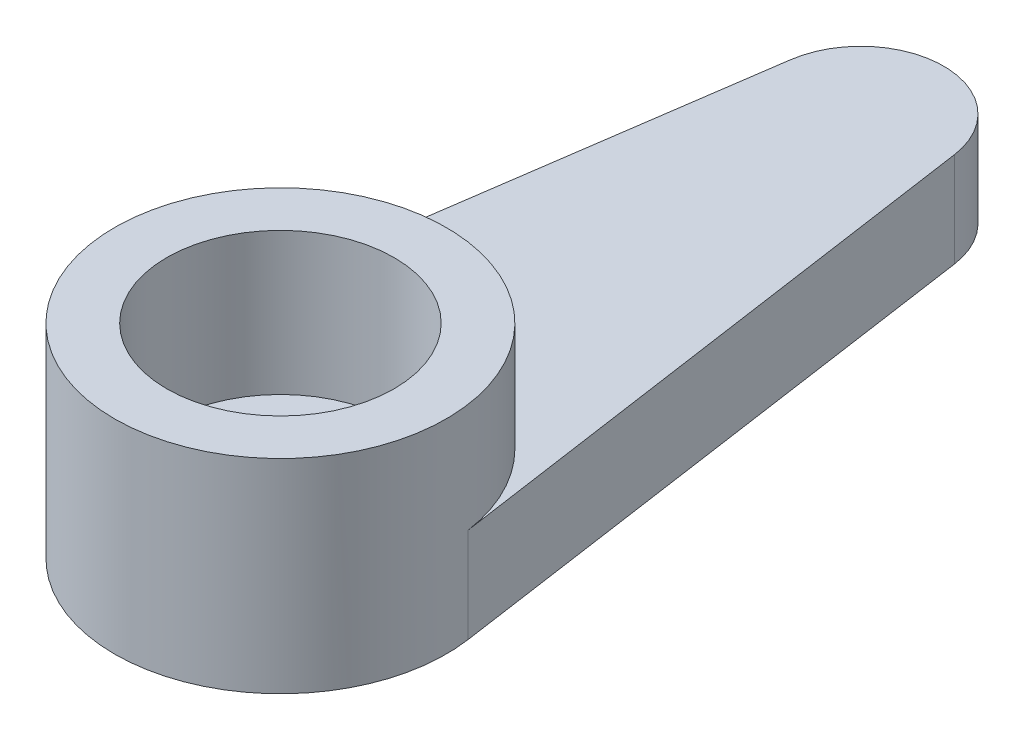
ISO-10303-21;
HEADER;
FILE_DESCRIPTION(('STEP AP214'),'2;1');
FILE_NAME('part.step','',(''),(''),'','','');
FILE_SCHEMA(('AUTOMOTIVE_DESIGN { 1 0 10303 214 1 1 1 1 }'));
ENDSEC;
DATA;
#1=APPLICATION_CONTEXT('core data for automotive mechanical design processes');
#2=APPLICATION_PROTOCOL_DEFINITION('international standard','automotive_design',2000,#1);
#3=PRODUCT_CONTEXT('',#1,'mechanical');
#4=PRODUCT('Part','Part','',(#3));
#5=PRODUCT_RELATED_PRODUCT_CATEGORY('part','',(#4));
#6=PRODUCT_DEFINITION_FORMATION('','',#4);
#7=PRODUCT_DEFINITION_CONTEXT('part definition',#1,'design');
#8=PRODUCT_DEFINITION('design','',#6,#7);
#9=PRODUCT_DEFINITION_SHAPE('','',#8);
#10=(LENGTH_UNIT() NAMED_UNIT(*) SI_UNIT(.MILLI.,.METRE.));
#11=(NAMED_UNIT(*) PLANE_ANGLE_UNIT() SI_UNIT($,.RADIAN.));
#12=(NAMED_UNIT(*) SI_UNIT($,.STERADIAN.) SOLID_ANGLE_UNIT());
#13=UNCERTAINTY_MEASURE_WITH_UNIT(LENGTH_MEASURE(1.E-05),#10,'distance_accuracy_value','');
#14=(GEOMETRIC_REPRESENTATION_CONTEXT(3) GLOBAL_UNCERTAINTY_ASSIGNED_CONTEXT((#13)) GLOBAL_UNIT_ASSIGNED_CONTEXT((#10,
#11,#12)) REPRESENTATION_CONTEXT('',''));
#15=CARTESIAN_POINT('',(0.,0.,0.));
#16=DIRECTION('',(0.,0.,1.));
#17=DIRECTION('',(1.,0.,0.));
#18=AXIS2_PLACEMENT_3D('',#15,#16,#17);
#19=CARTESIAN_POINT('',(0.,1.3,0.));
#20=DIRECTION('',(0.,1.,0.));
#21=DIRECTION('',(0.,0.,1.));
#22=AXIS2_PLACEMENT_3D('',#19,#20,#21);
#23=PLANE('',#22);
#24=CARTESIAN_POINT('',(0.,1.3,0.));
#25=DIRECTION('',(0.,-1.,0.));
#26=DIRECTION('',(0.,0.,-1.));
#27=AXIS2_PLACEMENT_3D('',#24,#25,#26);
#28=CIRCLE('',#27,1.);
#29=CARTESIAN_POINT('',(0.,1.3,-1.));
#30=VERTEX_POINT('',#29);
#31=EDGE_CURVE('E102',#30,#30,#28,.T.);
#32=ORIENTED_EDGE('',*,*,#31,.T.);
#33=EDGE_LOOP('',(#32));
#34=FACE_BOUND('',#33,.T.);
#35=CARTESIAN_POINT('',(0.,1.3,0.));
#36=DIRECTION('',(0.,1.,0.));
#37=DIRECTION('',(0.,0.,1.));
#38=AXIS2_PLACEMENT_3D('',#35,#36,#37);
#39=CIRCLE('',#38,2.4);
#40=CARTESIAN_POINT('',(0.,1.3,2.4));
#41=VERTEX_POINT('',#40);
#42=EDGE_CURVE('E19',#41,#41,#39,.T.);
#43=ORIENTED_EDGE('',*,*,#42,.T.);
#44=EDGE_LOOP('',(#43));
#45=FACE_BOUND('',#44,.T.);
#46=ADVANCED_FACE('F16',(#34,#45),#23,.T.);
#47=CARTESIAN_POINT('',(0.,4.3,0.));
#48=DIRECTION('',(0.,1.,0.));
#49=DIRECTION('',(0.,0.,1.));
#50=AXIS2_PLACEMENT_3D('',#47,#48,#49);
#51=CYLINDRICAL_SURFACE('',#50,2.4);
#52=CARTESIAN_POINT('',(0.,4.3,0.));
#53=DIRECTION('',(0.,1.,0.));
#54=DIRECTION('',(0.,0.,1.));
#55=AXIS2_PLACEMENT_3D('',#52,#53,#54);
#56=CIRCLE('',#55,2.4);
#57=CARTESIAN_POINT('',(0.,4.3,2.4));
#58=VERTEX_POINT('',#57);
#59=EDGE_CURVE('E100',#58,#58,#56,.F.);
#60=ORIENTED_EDGE('',*,*,#59,.F.);
#61=EDGE_LOOP('',(#60));
#62=FACE_BOUND('',#61,.T.);
#63=ORIENTED_EDGE('',*,*,#42,.F.);
#64=EDGE_LOOP('',(#63));
#65=FACE_BOUND('',#64,.T.);
#66=ADVANCED_FACE('F110',(#62,#65),#51,.F.);
#67=CARTESIAN_POINT('',(0.,0.,0.));
#68=DIRECTION('',(0.,-1.,0.));
#69=DIRECTION('',(0.,0.,-1.));
#70=AXIS2_PLACEMENT_3D('',#67,#68,#69);
#71=CYLINDRICAL_SURFACE('',#70,1.);
#72=CARTESIAN_POINT('',(0.,0.5,0.));
#73=DIRECTION('',(0.,-1.,0.));
#74=DIRECTION('',(0.,0.,-1.));
#75=AXIS2_PLACEMENT_3D('',#72,#73,#74);
#76=CIRCLE('',#75,1.);
#77=CARTESIAN_POINT('',(0.,0.5,-1.));
#78=VERTEX_POINT('',#77);
#79=EDGE_CURVE('E97',#78,#78,#76,.F.);
#80=ORIENTED_EDGE('',*,*,#79,.F.);
#81=EDGE_LOOP('',(#80));
#82=FACE_BOUND('',#81,.T.);
#83=ORIENTED_EDGE('',*,*,#31,.F.);
#84=EDGE_LOOP('',(#83));
#85=FACE_BOUND('',#84,.T.);
#86=ADVANCED_FACE('F112',(#82,#85),#71,.F.);
#87=CARTESIAN_POINT('',(0.,4.3,0.));
#88=DIRECTION('',(0.,1.,0.));
#89=DIRECTION('',(0.,0.,1.));
#90=AXIS2_PLACEMENT_3D('',#87,#88,#89);
#91=PLANE('',#90);
#92=ORIENTED_EDGE('',*,*,#59,.T.);
#93=EDGE_LOOP('',(#92));
#94=FACE_BOUND('',#93,.T.);
#95=CARTESIAN_POINT('',(0.,4.3,0.));
#96=DIRECTION('',(0.,1.,0.));
#97=DIRECTION('',(0.,0.,1.));
#98=AXIS2_PLACEMENT_3D('',#95,#96,#97);
#99=CIRCLE('',#98,3.5);
#100=CARTESIAN_POINT('',(0.,4.3,3.5));
#101=VERTEX_POINT('',#100);
#102=EDGE_CURVE('E74',#101,#101,#99,.F.);
#103=ORIENTED_EDGE('',*,*,#102,.F.);
#104=EDGE_LOOP('',(#103));
#105=FACE_BOUND('',#104,.T.);
#106=ADVANCED_FACE('F119',(#94,#105),#91,.T.);
#107=CARTESIAN_POINT('',(0.,2.,0.));
#108=DIRECTION('',(0.,1.,0.));
#109=DIRECTION('',(0.,0.,1.));
#110=AXIS2_PLACEMENT_3D('',#107,#108,#109);
#111=PLANE('',#110);
#112=DIRECTION('',(-0.142857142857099,0.,-0.989743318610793));
#113=VECTOR('',#112,1.);
#114=CARTESIAN_POINT('',(3.464101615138,2.,-0.5));
#115=LINE('',#114,#113);
#116=CARTESIAN_POINT('',(1.73205080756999,2.,-12.499999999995));
#117=VERTEX_POINT('',#116);
#118=CARTESIAN_POINT('',(3.46410161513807,2.,-0.499999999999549));
#119=VERTEX_POINT('',#118);
#120=EDGE_CURVE('E55',#117,#119,#115,.F.);
#121=ORIENTED_EDGE('',*,*,#120,.F.);
#122=CARTESIAN_POINT('',(0.,2.,-12.25));
#123=DIRECTION('',(0.,1.,0.));
#124=DIRECTION('',(0.,0.,1.));
#125=AXIS2_PLACEMENT_3D('',#122,#123,#124);
#126=CIRCLE('',#125,1.75);
#127=CARTESIAN_POINT('',(-1.732050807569,2.,-12.5));
#128=VERTEX_POINT('',#127);
#129=EDGE_CURVE('E79',#128,#117,#126,.F.);
#130=ORIENTED_EDGE('',*,*,#129,.F.);
#131=DIRECTION('',(-0.142857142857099,0.,0.989743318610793));
#132=VECTOR('',#131,1.);
#133=CARTESIAN_POINT('',(-1.732050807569,2.,-12.5));
#134=LINE('',#133,#132);
#135=CARTESIAN_POINT('',(-3.46410161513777,2.,-0.499999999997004));
#136=VERTEX_POINT('',#135);
#137=EDGE_CURVE('E70',#136,#128,#134,.F.);
#138=ORIENTED_EDGE('',*,*,#137,.F.);
#139=CARTESIAN_POINT('',(0.,2.,0.));
#140=DIRECTION('',(0.,1.,0.));
#141=DIRECTION('',(0.,0.,1.));
#142=AXIS2_PLACEMENT_3D('',#139,#140,#141);
#143=CIRCLE('',#142,3.5);
#144=EDGE_CURVE('E65',#119,#136,#143,.T.);
#145=ORIENTED_EDGE('',*,*,#144,.F.);
#146=EDGE_LOOP('',(#121,#130,#138,#145));
#147=FACE_BOUND('',#146,.T.);
#148=ADVANCED_FACE('F69',(#147),#111,.T.);
#149=CARTESIAN_POINT('',(0.,0.5,0.));
#150=DIRECTION('',(0.,-1.,0.));
#151=DIRECTION('',(0.,0.,-1.));
#152=AXIS2_PLACEMENT_3D('',#149,#150,#151);
#153=PLANE('',#152);
#154=ORIENTED_EDGE('',*,*,#79,.T.);
#155=EDGE_LOOP('',(#154));
#156=FACE_BOUND('',#155,.T.);
#157=CARTESIAN_POINT('',(0.,0.5,0.));
#158=DIRECTION('',(0.,-1.,0.));
#159=DIRECTION('',(0.,0.,-1.));
#160=AXIS2_PLACEMENT_3D('',#157,#158,#159);
#161=CIRCLE('',#160,1.65);
#162=CARTESIAN_POINT('',(0.,0.5,-1.65));
#163=VERTEX_POINT('',#162);
#164=EDGE_CURVE('E91',#163,#163,#161,.T.);
#165=ORIENTED_EDGE('',*,*,#164,.T.);
#166=EDGE_LOOP('',(#165));
#167=FACE_BOUND('',#166,.T.);
#168=ADVANCED_FACE('F147',(#156,#167),#153,.T.);
#169=CARTESIAN_POINT('',(0.,0.,0.));
#170=DIRECTION('',(0.,1.,0.));
#171=DIRECTION('',(0.,0.,1.));
#172=AXIS2_PLACEMENT_3D('',#169,#170,#171);
#173=CYLINDRICAL_SURFACE('',#172,3.5);
#174=CARTESIAN_POINT('',(0.,0.,0.));
#175=DIRECTION('',(0.,1.,0.));
#176=DIRECTION('',(0.,0.,1.));
#177=AXIS2_PLACEMENT_3D('',#174,#175,#176);
#178=CIRCLE('',#177,3.5);
#179=CARTESIAN_POINT('',(-3.46410161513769,0.,-0.499999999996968));
#180=VERTEX_POINT('',#179);
#181=CARTESIAN_POINT('',(3.46410161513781,0.,-0.499999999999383));
#182=VERTEX_POINT('',#181);
#183=EDGE_CURVE('E78',#180,#182,#178,.T.);
#184=ORIENTED_EDGE('',*,*,#183,.T.);
#185=DIRECTION('',(0.,1.,0.));
#186=VECTOR('',#185,1.);
#187=CARTESIAN_POINT('',(3.46410161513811,0.,-0.499999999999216));
#188=LINE('',#187,#186);
#189=EDGE_CURVE('E60',#119,#182,#188,.F.);
#190=ORIENTED_EDGE('',*,*,#189,.F.);
#191=ORIENTED_EDGE('',*,*,#144,.T.);
#192=DIRECTION('',(0.,1.,0.));
#193=VECTOR('',#192,1.);
#194=CARTESIAN_POINT('',(-3.46410161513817,0.,-0.499999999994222));
#195=LINE('',#194,#193);
#196=EDGE_CURVE('E93',#180,#136,#195,.T.);
#197=ORIENTED_EDGE('',*,*,#196,.F.);
#198=EDGE_LOOP('',(#184,#190,#191,#197));
#199=FACE_BOUND('',#198,.T.);
#200=ORIENTED_EDGE('',*,*,#102,.T.);
#201=EDGE_LOOP('',(#200));
#202=FACE_BOUND('',#201,.T.);
#203=ADVANCED_FACE('F76',(#199,#202),#173,.T.);
#204=CARTESIAN_POINT('',(3.464101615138,0.,-0.5));
#205=DIRECTION('',(0.989743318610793,0.,-0.142857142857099));
#206=DIRECTION('',(-0.142857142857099,0.,-0.989743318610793));
#207=AXIS2_PLACEMENT_3D('',#204,#205,#206);
#208=PLANE('',#207);
#209=DIRECTION('',(-0.142857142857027,0.,-0.989743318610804));
#210=VECTOR('',#209,1.);
#211=CARTESIAN_POINT('',(3.464101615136,0.,-0.50000000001));
#212=LINE('',#211,#210);
#213=CARTESIAN_POINT('',(1.73205080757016,0.,-12.499999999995));
#214=VERTEX_POINT('',#213);
#215=EDGE_CURVE('E89',#182,#214,#212,.T.);
#216=ORIENTED_EDGE('',*,*,#215,.T.);
#217=DIRECTION('',(0.,1.,0.));
#218=VECTOR('',#217,1.);
#219=CARTESIAN_POINT('',(1.73205080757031,0.,-12.49999999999));
#220=LINE('',#219,#218);
#221=EDGE_CURVE('E62',#117,#214,#220,.F.);
#222=ORIENTED_EDGE('',*,*,#221,.F.);
#223=ORIENTED_EDGE('',*,*,#120,.T.);
#224=ORIENTED_EDGE('',*,*,#189,.T.);
#225=EDGE_LOOP('',(#216,#222,#223,#224));
#226=FACE_BOUND('',#225,.T.);
#227=ADVANCED_FACE('F58',(#226),#208,.T.);
#228=CARTESIAN_POINT('',(0.,0.,-12.25));
#229=DIRECTION('',(0.,1.,0.));
#230=DIRECTION('',(0.,0.,1.));
#231=AXIS2_PLACEMENT_3D('',#228,#229,#230);
#232=CYLINDRICAL_SURFACE('',#231,1.75);
#233=CARTESIAN_POINT('',(0.,0.,-12.25));
#234=DIRECTION('',(0.,1.,0.));
#235=DIRECTION('',(0.,0.,1.));
#236=AXIS2_PLACEMENT_3D('',#233,#234,#235);
#237=CIRCLE('',#236,1.75);
#238=CARTESIAN_POINT('',(-1.73205080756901,0.,-12.5));
#239=VERTEX_POINT('',#238);
#240=EDGE_CURVE('E86',#214,#239,#237,.T.);
#241=ORIENTED_EDGE('',*,*,#240,.T.);
#242=DIRECTION('',(0.,1.,0.));
#243=VECTOR('',#242,1.);
#244=CARTESIAN_POINT('',(-1.732050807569,0.,-12.5));
#245=LINE('',#244,#243);
#246=EDGE_CURVE('E34',#128,#239,#245,.F.);
#247=ORIENTED_EDGE('',*,*,#246,.F.);
#248=ORIENTED_EDGE('',*,*,#129,.T.);
#249=ORIENTED_EDGE('',*,*,#221,.T.);
#250=EDGE_LOOP('',(#241,#247,#248,#249));
#251=FACE_BOUND('',#250,.T.);
#252=ADVANCED_FACE('F139',(#251),#232,.T.);
#253=CARTESIAN_POINT('',(-1.732050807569,0.,-12.5));
#254=DIRECTION('',(-0.989743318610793,0.,-0.142857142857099));
#255=DIRECTION('',(-0.142857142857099,0.,0.989743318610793));
#256=AXIS2_PLACEMENT_3D('',#253,#254,#255);
#257=PLANE('',#256);
#258=DIRECTION('',(-0.142857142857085,0.,0.989743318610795));
#259=VECTOR('',#258,1.);
#260=CARTESIAN_POINT('',(-1.732050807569,0.,-12.5));
#261=LINE('',#260,#259);
#262=EDGE_CURVE('E25',#239,#180,#261,.T.);
#263=ORIENTED_EDGE('',*,*,#262,.T.);
#264=ORIENTED_EDGE('',*,*,#196,.T.);
#265=ORIENTED_EDGE('',*,*,#137,.T.);
#266=ORIENTED_EDGE('',*,*,#246,.T.);
#267=EDGE_LOOP('',(#263,#264,#265,#266));
#268=FACE_BOUND('',#267,.T.);
#269=ADVANCED_FACE('F131',(#268),#257,.T.);
#270=CARTESIAN_POINT('',(0.,0.,0.));
#271=DIRECTION('',(0.,-1.,0.));
#272=DIRECTION('',(0.,0.,-1.));
#273=AXIS2_PLACEMENT_3D('',#270,#271,#272);
#274=CYLINDRICAL_SURFACE('',#273,1.65);
#275=CARTESIAN_POINT('',(0.,0.,0.));
#276=DIRECTION('',(0.,-1.,0.));
#277=DIRECTION('',(0.,0.,-1.));
#278=AXIS2_PLACEMENT_3D('',#275,#276,#277);
#279=CIRCLE('',#278,1.65);
#280=CARTESIAN_POINT('',(0.,0.,-1.65));
#281=VERTEX_POINT('',#280);
#282=EDGE_CURVE('E11',#281,#281,#279,.T.);
#283=ORIENTED_EDGE('',*,*,#282,.T.);
#284=EDGE_LOOP('',(#283));
#285=FACE_BOUND('',#284,.T.);
#286=ORIENTED_EDGE('',*,*,#164,.F.);
#287=EDGE_LOOP('',(#286));
#288=FACE_BOUND('',#287,.T.);
#289=ADVANCED_FACE('F125',(#285,#288),#274,.F.);
#290=CARTESIAN_POINT('',(0.,0.,0.));
#291=DIRECTION('',(0.,1.,0.));
#292=DIRECTION('',(0.,0.,1.));
#293=AXIS2_PLACEMENT_3D('',#290,#291,#292);
#294=PLANE('',#293);
#295=ORIENTED_EDGE('',*,*,#282,.F.);
#296=EDGE_LOOP('',(#295));
#297=FACE_BOUND('',#296,.T.);
#298=ORIENTED_EDGE('',*,*,#240,.F.);
#299=ORIENTED_EDGE('',*,*,#215,.F.);
#300=ORIENTED_EDGE('',*,*,#183,.F.);
#301=ORIENTED_EDGE('',*,*,#262,.F.);
#302=EDGE_LOOP('',(#298,#299,#300,#301));
#303=FACE_BOUND('',#302,.T.);
#304=ADVANCED_FACE('F123',(#297,#303),#294,.F.);
#305=CLOSED_SHELL('',(#46,#66,#86,#106,#148,#168,#203,#227,#252,#269,#289,#304));
#306=MANIFOLD_SOLID_BREP('B1',#305);
#307=ADVANCED_BREP_SHAPE_REPRESENTATION('',(#18,#306),#14);
#308=SHAPE_DEFINITION_REPRESENTATION(#9,#307);
ENDSEC;
END-ISO-10303-21;
